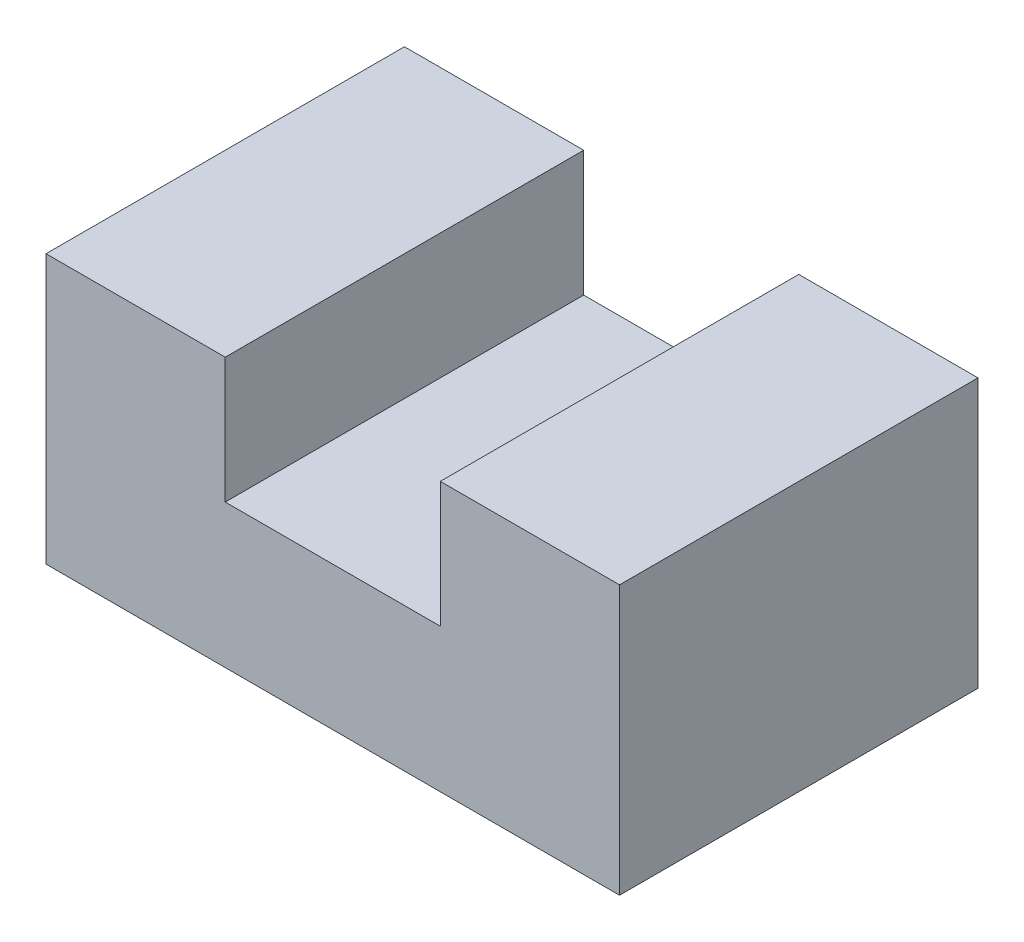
ISO-10303-21;
HEADER;
FILE_DESCRIPTION(('STEP AP214'),'2;1');
FILE_NAME('part.step','',(''),(''),'','','');
FILE_SCHEMA(('AUTOMOTIVE_DESIGN { 1 0 10303 214 1 1 1 1 }'));
ENDSEC;
DATA;
#1=APPLICATION_CONTEXT('core data for automotive mechanical design processes');
#2=APPLICATION_PROTOCOL_DEFINITION('international standard','automotive_design',2000,#1);
#3=PRODUCT_CONTEXT('',#1,'mechanical');
#4=PRODUCT('Part','Part','',(#3));
#5=PRODUCT_RELATED_PRODUCT_CATEGORY('part','',(#4));
#6=PRODUCT_DEFINITION_FORMATION('','',#4);
#7=PRODUCT_DEFINITION_CONTEXT('part definition',#1,'design');
#8=PRODUCT_DEFINITION('design','',#6,#7);
#9=PRODUCT_DEFINITION_SHAPE('','',#8);
#10=(LENGTH_UNIT() NAMED_UNIT(*) SI_UNIT(.MILLI.,.METRE.));
#11=(NAMED_UNIT(*) PLANE_ANGLE_UNIT() SI_UNIT($,.RADIAN.));
#12=(NAMED_UNIT(*) SI_UNIT($,.STERADIAN.) SOLID_ANGLE_UNIT());
#13=UNCERTAINTY_MEASURE_WITH_UNIT(LENGTH_MEASURE(1.E-05),#10,'distance_accuracy_value','');
#14=(GEOMETRIC_REPRESENTATION_CONTEXT(3) GLOBAL_UNCERTAINTY_ASSIGNED_CONTEXT((#13)) GLOBAL_UNIT_ASSIGNED_CONTEXT((#10,
#11,#12)) REPRESENTATION_CONTEXT('',''));
#15=CARTESIAN_POINT('',(0.,0.,0.));
#16=DIRECTION('',(0.,0.,1.));
#17=DIRECTION('',(1.,0.,0.));
#18=AXIS2_PLACEMENT_3D('',#15,#16,#17);
#19=CARTESIAN_POINT('',(-80.,75.,50.));
#20=DIRECTION('',(1.,0.,0.));
#21=DIRECTION('',(0.,1.,0.));
#22=AXIS2_PLACEMENT_3D('',#19,#20,#21);
#23=PLANE('',#22);
#24=DIRECTION('',(0.,-1.,0.));
#25=VECTOR('',#24,1.);
#26=CARTESIAN_POINT('',(-80.,75.,-50.));
#27=LINE('',#26,#25);
#28=CARTESIAN_POINT('',(-80.,75.,-50.));
#29=VERTEX_POINT('',#28);
#30=CARTESIAN_POINT('',(-80.,0.,-50.));
#31=VERTEX_POINT('',#30);
#32=EDGE_CURVE('E142',#29,#31,#27,.T.);
#33=ORIENTED_EDGE('',*,*,#32,.T.);
#34=DIRECTION('',(0.,0.,-1.));
#35=VECTOR('',#34,1.);
#36=CARTESIAN_POINT('',(-80.,0.,50.));
#37=LINE('',#36,#35);
#38=CARTESIAN_POINT('',(-80.,0.,50.));
#39=VERTEX_POINT('',#38);
#40=EDGE_CURVE('E11',#39,#31,#37,.T.);
#41=ORIENTED_EDGE('',*,*,#40,.F.);
#42=DIRECTION('',(0.,-1.,0.));
#43=VECTOR('',#42,1.);
#44=CARTESIAN_POINT('',(-80.,75.,50.));
#45=LINE('',#44,#43);
#46=CARTESIAN_POINT('',(-80.,75.,50.));
#47=VERTEX_POINT('',#46);
#48=EDGE_CURVE('E164',#47,#39,#45,.T.);
#49=ORIENTED_EDGE('',*,*,#48,.F.);
#50=DIRECTION('',(0.,0.,-1.));
#51=VECTOR('',#50,1.);
#52=CARTESIAN_POINT('',(-80.,75.,50.));
#53=LINE('',#52,#51);
#54=EDGE_CURVE('E138',#47,#29,#53,.T.);
#55=ORIENTED_EDGE('',*,*,#54,.T.);
#56=EDGE_LOOP('',(#33,#41,#49,#55));
#57=FACE_BOUND('',#56,.T.);
#58=ADVANCED_FACE('F41',(#57),#23,.F.);
#59=CARTESIAN_POINT('',(-80.,0.,50.));
#60=DIRECTION('',(0.,1.,0.));
#61=DIRECTION('',(0.,0.,1.));
#62=AXIS2_PLACEMENT_3D('',#59,#60,#61);
#63=PLANE('',#62);
#64=DIRECTION('',(1.,0.,0.));
#65=VECTOR('',#64,1.);
#66=CARTESIAN_POINT('',(-80.,0.,-50.));
#67=LINE('',#66,#65);
#68=CARTESIAN_POINT('',(80.,0.,-50.));
#69=VERTEX_POINT('',#68);
#70=EDGE_CURVE('E146',#31,#69,#67,.T.);
#71=ORIENTED_EDGE('',*,*,#70,.T.);
#72=DIRECTION('',(0.,0.,-1.));
#73=VECTOR('',#72,1.);
#74=CARTESIAN_POINT('',(80.,0.,50.));
#75=LINE('',#74,#73);
#76=CARTESIAN_POINT('',(80.,0.,50.));
#77=VERTEX_POINT('',#76);
#78=EDGE_CURVE('E50',#77,#69,#75,.T.);
#79=ORIENTED_EDGE('',*,*,#78,.F.);
#80=DIRECTION('',(1.,0.,0.));
#81=VECTOR('',#80,1.);
#82=CARTESIAN_POINT('',(-80.,0.,50.));
#83=LINE('',#82,#81);
#84=EDGE_CURVE('E101',#39,#77,#83,.T.);
#85=ORIENTED_EDGE('',*,*,#84,.F.);
#86=ORIENTED_EDGE('',*,*,#40,.T.);
#87=EDGE_LOOP('',(#71,#79,#85,#86));
#88=FACE_BOUND('',#87,.T.);
#89=ADVANCED_FACE('F210',(#88),#63,.F.);
#90=CARTESIAN_POINT('',(80.,0.,50.));
#91=DIRECTION('',(-1.,0.,0.));
#92=DIRECTION('',(0.,0.,1.));
#93=AXIS2_PLACEMENT_3D('',#90,#91,#92);
#94=PLANE('',#93);
#95=DIRECTION('',(0.,1.,0.));
#96=VECTOR('',#95,1.);
#97=CARTESIAN_POINT('',(80.,0.,-50.));
#98=LINE('',#97,#96);
#99=CARTESIAN_POINT('',(80.,75.,-50.));
#100=VERTEX_POINT('',#99);
#101=EDGE_CURVE('E149',#69,#100,#98,.T.);
#102=ORIENTED_EDGE('',*,*,#101,.T.);
#103=DIRECTION('',(0.,0.,-1.));
#104=VECTOR('',#103,1.);
#105=CARTESIAN_POINT('',(80.,75.,50.));
#106=LINE('',#105,#104);
#107=CARTESIAN_POINT('',(80.,75.,50.));
#108=VERTEX_POINT('',#107);
#109=EDGE_CURVE('E175',#108,#100,#106,.T.);
#110=ORIENTED_EDGE('',*,*,#109,.F.);
#111=DIRECTION('',(0.,1.,0.));
#112=VECTOR('',#111,1.);
#113=CARTESIAN_POINT('',(80.,0.,50.));
#114=LINE('',#113,#112);
#115=EDGE_CURVE('E185',#77,#108,#114,.T.);
#116=ORIENTED_EDGE('',*,*,#115,.F.);
#117=ORIENTED_EDGE('',*,*,#78,.T.);
#118=EDGE_LOOP('',(#102,#110,#116,#117));
#119=FACE_BOUND('',#118,.T.);
#120=ADVANCED_FACE('F183',(#119),#94,.F.);
#121=CARTESIAN_POINT('',(80.,75.,50.));
#122=DIRECTION('',(0.,-1.,0.));
#123=DIRECTION('',(1.,0.,0.));
#124=AXIS2_PLACEMENT_3D('',#121,#122,#123);
#125=PLANE('',#124);
#126=DIRECTION('',(-1.,0.,0.));
#127=VECTOR('',#126,1.);
#128=CARTESIAN_POINT('',(80.,75.,-50.));
#129=LINE('',#128,#127);
#130=CARTESIAN_POINT('',(30.,75.,-50.));
#131=VERTEX_POINT('',#130);
#132=EDGE_CURVE('E152',#100,#131,#129,.T.);
#133=ORIENTED_EDGE('',*,*,#132,.T.);
#134=DIRECTION('',(0.,0.,-1.));
#135=VECTOR('',#134,1.);
#136=CARTESIAN_POINT('',(30.,75.,50.));
#137=LINE('',#136,#135);
#138=CARTESIAN_POINT('',(30.,75.,50.));
#139=VERTEX_POINT('',#138);
#140=EDGE_CURVE('E171',#139,#131,#137,.T.);
#141=ORIENTED_EDGE('',*,*,#140,.F.);
#142=DIRECTION('',(-1.,0.,0.));
#143=VECTOR('',#142,1.);
#144=CARTESIAN_POINT('',(80.,75.,50.));
#145=LINE('',#144,#143);
#146=EDGE_CURVE('E198',#108,#139,#145,.T.);
#147=ORIENTED_EDGE('',*,*,#146,.F.);
#148=ORIENTED_EDGE('',*,*,#109,.T.);
#149=EDGE_LOOP('',(#133,#141,#147,#148));
#150=FACE_BOUND('',#149,.T.);
#151=ADVANCED_FACE('F193',(#150),#125,.F.);
#152=CARTESIAN_POINT('',(30.,75.,50.));
#153=DIRECTION('',(1.,0.,0.));
#154=DIRECTION('',(0.,1.,0.));
#155=AXIS2_PLACEMENT_3D('',#152,#153,#154);
#156=PLANE('',#155);
#157=DIRECTION('',(0.,-1.,0.));
#158=VECTOR('',#157,1.);
#159=CARTESIAN_POINT('',(30.,75.,-50.));
#160=LINE('',#159,#158);
#161=CARTESIAN_POINT('',(30.,40.,-50.));
#162=VERTEX_POINT('',#161);
#163=EDGE_CURVE('E155',#131,#162,#160,.T.);
#164=ORIENTED_EDGE('',*,*,#163,.T.);
#165=DIRECTION('',(0.,0.,-1.));
#166=VECTOR('',#165,1.);
#167=CARTESIAN_POINT('',(30.,40.,50.));
#168=LINE('',#167,#166);
#169=CARTESIAN_POINT('',(30.,40.,50.));
#170=VERTEX_POINT('',#169);
#171=EDGE_CURVE('E131',#170,#162,#168,.T.);
#172=ORIENTED_EDGE('',*,*,#171,.F.);
#173=DIRECTION('',(0.,-1.,0.));
#174=VECTOR('',#173,1.);
#175=CARTESIAN_POINT('',(30.,75.,50.));
#176=LINE('',#175,#174);
#177=EDGE_CURVE('E120',#139,#170,#176,.T.);
#178=ORIENTED_EDGE('',*,*,#177,.F.);
#179=ORIENTED_EDGE('',*,*,#140,.T.);
#180=EDGE_LOOP('',(#164,#172,#178,#179));
#181=FACE_BOUND('',#180,.T.);
#182=ADVANCED_FACE('F196',(#181),#156,.F.);
#183=CARTESIAN_POINT('',(30.,40.,50.));
#184=DIRECTION('',(0.,-1.,0.));
#185=DIRECTION('',(1.,0.,0.));
#186=AXIS2_PLACEMENT_3D('',#183,#184,#185);
#187=PLANE('',#186);
#188=DIRECTION('',(-1.,0.,0.));
#189=VECTOR('',#188,1.);
#190=CARTESIAN_POINT('',(30.,40.,-50.));
#191=LINE('',#190,#189);
#192=CARTESIAN_POINT('',(-30.,40.,-50.));
#193=VERTEX_POINT('',#192);
#194=EDGE_CURVE('E129',#162,#193,#191,.T.);
#195=ORIENTED_EDGE('',*,*,#194,.T.);
#196=DIRECTION('',(0.,0.,-1.));
#197=VECTOR('',#196,1.);
#198=CARTESIAN_POINT('',(-30.,40.,50.));
#199=LINE('',#198,#197);
#200=CARTESIAN_POINT('',(-30.,40.,50.));
#201=VERTEX_POINT('',#200);
#202=EDGE_CURVE('E126',#201,#193,#199,.T.);
#203=ORIENTED_EDGE('',*,*,#202,.F.);
#204=DIRECTION('',(-1.,0.,0.));
#205=VECTOR('',#204,1.);
#206=CARTESIAN_POINT('',(30.,40.,50.));
#207=LINE('',#206,#205);
#208=EDGE_CURVE('E114',#170,#201,#207,.T.);
#209=ORIENTED_EDGE('',*,*,#208,.F.);
#210=ORIENTED_EDGE('',*,*,#171,.T.);
#211=EDGE_LOOP('',(#195,#203,#209,#210));
#212=FACE_BOUND('',#211,.T.);
#213=ADVANCED_FACE('F127',(#212),#187,.F.);
#214=CARTESIAN_POINT('',(-30.,40.,50.));
#215=DIRECTION('',(-1.,0.,0.));
#216=DIRECTION('',(0.,-1.,0.));
#217=AXIS2_PLACEMENT_3D('',#214,#215,#216);
#218=PLANE('',#217);
#219=DIRECTION('',(0.,1.,0.));
#220=VECTOR('',#219,1.);
#221=CARTESIAN_POINT('',(-30.,40.,-50.));
#222=LINE('',#221,#220);
#223=CARTESIAN_POINT('',(-30.,75.,-50.));
#224=VERTEX_POINT('',#223);
#225=EDGE_CURVE('E87',#193,#224,#222,.T.);
#226=ORIENTED_EDGE('',*,*,#225,.T.);
#227=DIRECTION('',(0.,0.,-1.));
#228=VECTOR('',#227,1.);
#229=CARTESIAN_POINT('',(-30.,75.,50.));
#230=LINE('',#229,#228);
#231=CARTESIAN_POINT('',(-30.,75.,50.));
#232=VERTEX_POINT('',#231);
#233=EDGE_CURVE('E132',#232,#224,#230,.T.);
#234=ORIENTED_EDGE('',*,*,#233,.F.);
#235=DIRECTION('',(0.,1.,0.));
#236=VECTOR('',#235,1.);
#237=CARTESIAN_POINT('',(-30.,40.,50.));
#238=LINE('',#237,#236);
#239=EDGE_CURVE('E118',#201,#232,#238,.T.);
#240=ORIENTED_EDGE('',*,*,#239,.F.);
#241=ORIENTED_EDGE('',*,*,#202,.T.);
#242=EDGE_LOOP('',(#226,#234,#240,#241));
#243=FACE_BOUND('',#242,.T.);
#244=ADVANCED_FACE('F134',(#243),#218,.F.);
#245=CARTESIAN_POINT('',(-30.,75.,50.));
#246=DIRECTION('',(0.,-1.,0.));
#247=DIRECTION('',(0.,0.,-1.));
#248=AXIS2_PLACEMENT_3D('',#245,#246,#247);
#249=PLANE('',#248);
#250=DIRECTION('',(-1.,0.,0.));
#251=VECTOR('',#250,1.);
#252=CARTESIAN_POINT('',(-30.,75.,-50.));
#253=LINE('',#252,#251);
#254=EDGE_CURVE('E93',#224,#29,#253,.T.);
#255=ORIENTED_EDGE('',*,*,#254,.T.);
#256=ORIENTED_EDGE('',*,*,#54,.F.);
#257=DIRECTION('',(-1.,0.,0.));
#258=VECTOR('',#257,1.);
#259=CARTESIAN_POINT('',(-30.,75.,50.));
#260=LINE('',#259,#258);
#261=EDGE_CURVE('E58',#232,#47,#260,.T.);
#262=ORIENTED_EDGE('',*,*,#261,.F.);
#263=ORIENTED_EDGE('',*,*,#233,.T.);
#264=EDGE_LOOP('',(#255,#256,#262,#263));
#265=FACE_BOUND('',#264,.T.);
#266=ADVANCED_FACE('F226',(#265),#249,.F.);
#267=CARTESIAN_POINT('',(0.,0.,50.));
#268=DIRECTION('',(0.,0.,1.));
#269=DIRECTION('',(1.,0.,0.));
#270=AXIS2_PLACEMENT_3D('',#267,#268,#269);
#271=PLANE('',#270);
#272=ORIENTED_EDGE('',*,*,#48,.T.);
#273=ORIENTED_EDGE('',*,*,#84,.T.);
#274=ORIENTED_EDGE('',*,*,#115,.T.);
#275=ORIENTED_EDGE('',*,*,#146,.T.);
#276=ORIENTED_EDGE('',*,*,#177,.T.);
#277=ORIENTED_EDGE('',*,*,#208,.T.);
#278=ORIENTED_EDGE('',*,*,#239,.T.);
#279=ORIENTED_EDGE('',*,*,#261,.T.);
#280=EDGE_LOOP('',(#272,#273,#274,#275,#276,#277,#278,#279));
#281=FACE_BOUND('',#280,.T.);
#282=ADVANCED_FACE('F116',(#281),#271,.T.);
#283=CARTESIAN_POINT('',(0.,0.,-50.));
#284=DIRECTION('',(0.,0.,1.));
#285=DIRECTION('',(1.,0.,0.));
#286=AXIS2_PLACEMENT_3D('',#283,#284,#285);
#287=PLANE('',#286);
#288=ORIENTED_EDGE('',*,*,#32,.F.);
#289=ORIENTED_EDGE('',*,*,#254,.F.);
#290=ORIENTED_EDGE('',*,*,#225,.F.);
#291=ORIENTED_EDGE('',*,*,#194,.F.);
#292=ORIENTED_EDGE('',*,*,#163,.F.);
#293=ORIENTED_EDGE('',*,*,#132,.F.);
#294=ORIENTED_EDGE('',*,*,#101,.F.);
#295=ORIENTED_EDGE('',*,*,#70,.F.);
#296=EDGE_LOOP('',(#288,#289,#290,#291,#292,#293,#294,#295));
#297=FACE_BOUND('',#296,.T.);
#298=ADVANCED_FACE('F189',(#297),#287,.F.);
#299=CLOSED_SHELL('',(#58,#89,#120,#151,#182,#213,#244,#266,#282,#298));
#300=MANIFOLD_SOLID_BREP('B2',#299);
#301=ADVANCED_BREP_SHAPE_REPRESENTATION('',(#18,#300),#14);
#302=SHAPE_DEFINITION_REPRESENTATION(#9,#301);
ENDSEC;
END-ISO-10303-21;
